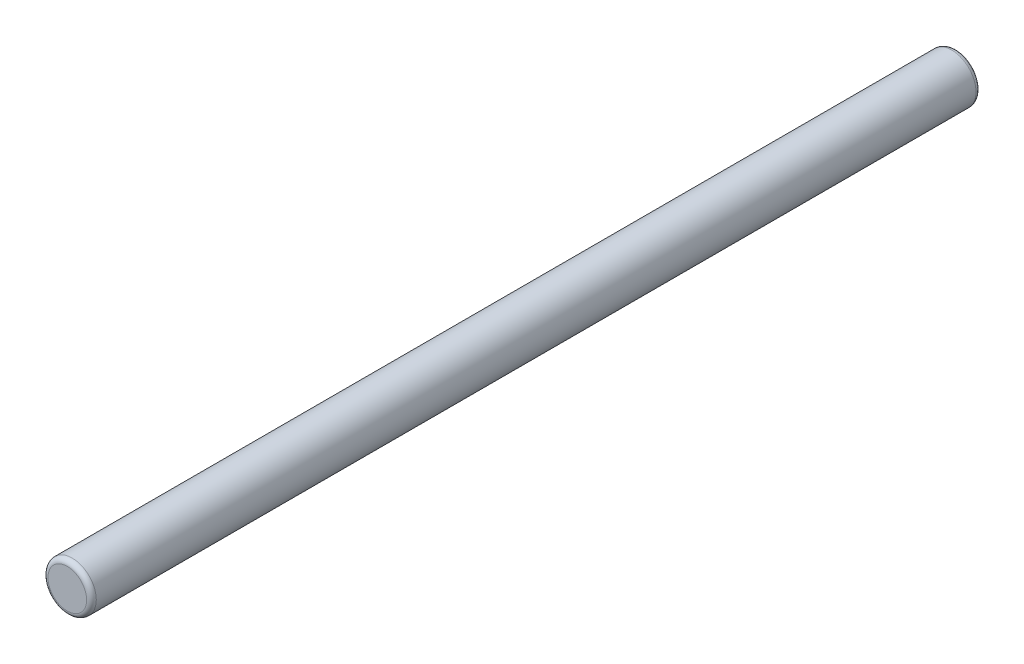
from build123d import *

# Parameters (mm, degrees)
ESQUISSE1_R      = 1
EXTRUSION1_DEPTH = 36.8
CONG_1_R         = 0.2


with BuildPart() as part:
    # Esquisse1 → Extrusion1 (new body)
    with BuildSketch(Plane.XY):
        Circle(ESQUISSE1_R)
    extrude(amount=-EXTRUSION1_DEPTH)

    # Cong_1
    cong_1_edges = [part.edges().sort_by_distance(p)[0] for p in [
        (-1, 0, 0),
        (-1, 0, -36.8),
    ]]
    fillet(cong_1_edges, radius=CONG_1_R)


solid = part.part
